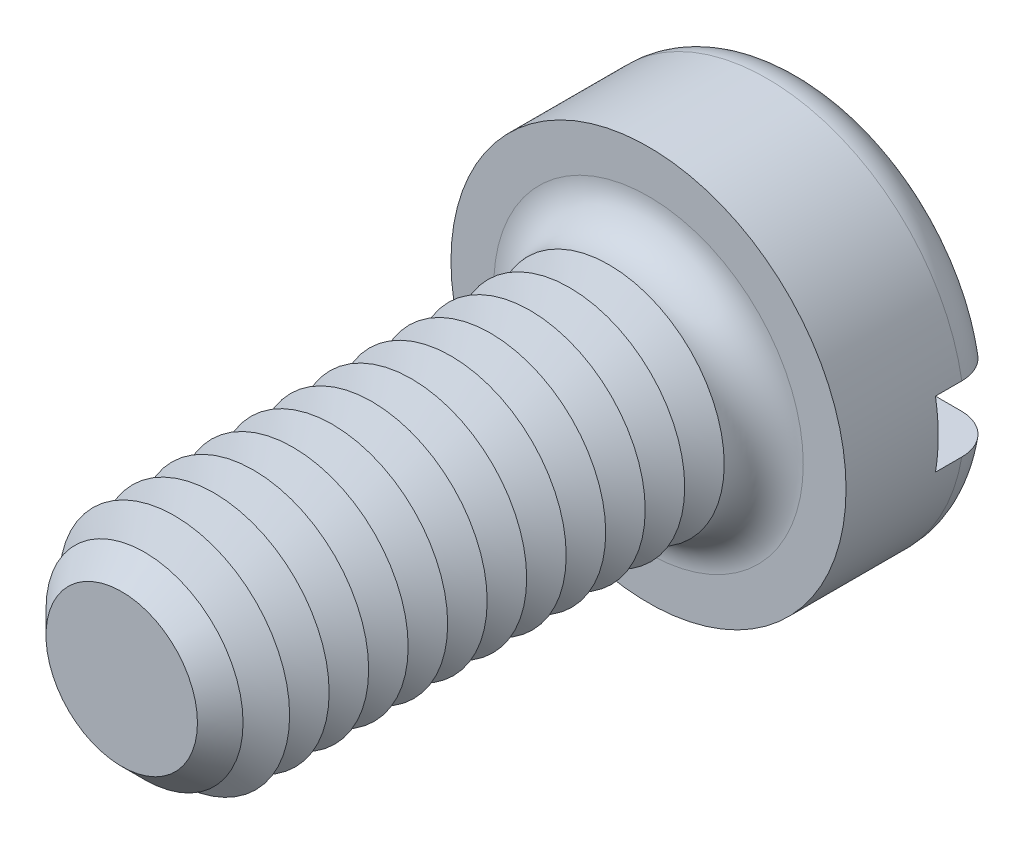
from build123d import *

# Parameters (mm, degrees)
SKETCH3_R           = 3
BOSS_EXTRUDE2_DEPTH = 2.4
SKETCH4_R           = 1.75
BOSS_EXTRUDE3_DEPTH = 8
FILLET1_R           = 0.6
CHAMFER1_SIZE       = 0.6
LPATTERN1_COUNT     = 12
LPATTERN1_PITCH     = 0.6
SKETCH8_W           = 6
SKETCH8_H           = 1
CUT_EXTRUDE1_DEPTH  = 1


with BuildPart() as part:
    # Sketch3 → Boss-Extrude2 (new body)
    with BuildSketch(Plane.XY):
        Circle(SKETCH3_R)
    extrude(amount=-BOSS_EXTRUDE2_DEPTH)

    # Sketch4 → Boss-Extrude3 (add)
    with BuildSketch(Plane.XY):
        Circle(SKETCH4_R)
    extrude(amount=BOSS_EXTRUDE3_DEPTH)

    # Fillet1
    fillet1_edges = [part.edges().sort_by_distance(p)[0] for p in [
        (-3, 0, -2.4),
        (-1.75, 0, 0),
    ]]
    fillet(fillet1_edges, radius=FILLET1_R)

    # Chamfer1
    chamfer1_edges = [part.edges().sort_by_distance(p)[0] for p in [
        (-1.75, 0, 8),
    ]]
    chamfer(chamfer1_edges, length=CHAMFER1_SIZE)

    # Sketch6 → Cut-Revolve1 (revolve, cut)
    with BuildSketch(Plane(origin=(0, 0, 0), x_dir=(0, 0, -1), z_dir=(1, 0, 0)), mode=Mode.PRIVATE) as cut_revolve1_sk:
        Polygon((-0.6, 1.75), (-0.9, 1.230384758), (-1.2, 1.75), align=None)
    cut_revolve1 = revolve(cut_revolve1_sk.sketch.rotate(Axis((0, 0, -1.694361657), (0, 0, 1)), 90), axis=Axis((0, 0, -1.694361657), (0, 0, 1)), mode=Mode.SUBTRACT)

    # LPattern1: Cut-Revolve1 ×12
    with Locations(*[(0, 0, i * LPATTERN1_PITCH) for i in range(1, LPATTERN1_COUNT)]):
        add(cut_revolve1, mode=Mode.SUBTRACT)

    # Sketch8 → Cut-Extrude1 (cut)
    with BuildSketch(Plane(origin=(0, 0, -2.4), x_dir=(-1, 0, 0), z_dir=(0, 0, -1))):
        Rectangle(SKETCH8_W, SKETCH8_H)
    extrude(amount=-CUT_EXTRUDE1_DEPTH, mode=Mode.SUBTRACT)


solid = part.part
